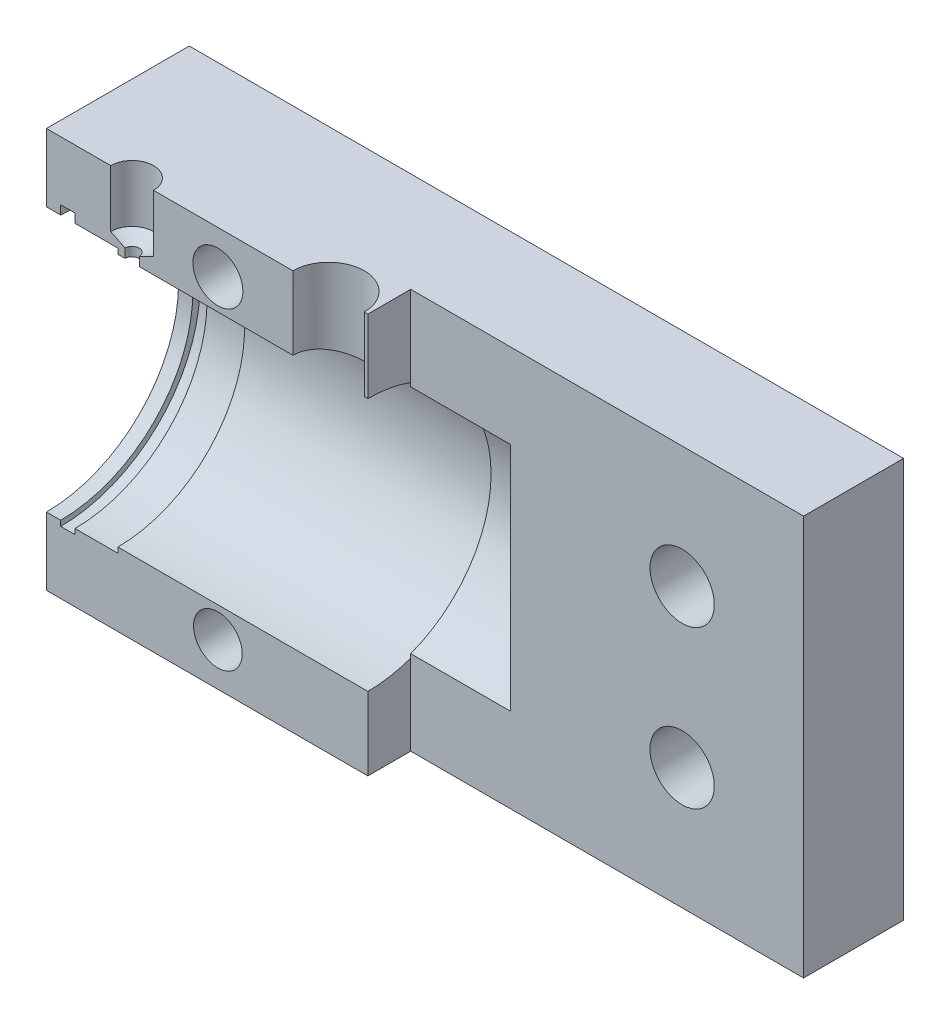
from build123d import *

# Parameters (mm, degrees)
ESQUISSE1_W                              = 100
ESQUISSE1_H                              = 56
BASE_EXTRUSION_DEPTH                     = 40
ESQUISSE3_R                              = 4.5
ENL_V_MAT_EXTRU_2_DEPTH                  = 40
ESQUISSE4_R                              = 17.75
ENL_V_MAT_EXTRU_4_DEPTH                  = 45
ESQUISSE5_R                              = 18.5
ENL_V_MAT_EXTRU_5_DEPTH                  = 10
ESQUISSE6_W                              = 12
ESQUISSE6_H                              = 56
ENL_V_MAT_EXTRU_6_DEPTH                  = 55
ESQUISSE7_W                              = 100
ESQUISSE7_H                              = 56
ENL_V_MAT_EXTRU_7_DEPTH                  = 20
ESQUISSE8_R                              = 3
ENL_V_MAT_EXTRU_8_DEPTH                  = 8
ESQUISSE9_R                              = 1
ENL_V_MAT_EXTRU_9_DEPTH                  = 8
ESQUISSE10_R                             = 5
ENL_V_MAT_EXTRU_10_DEPTH                 = 14
ESQUISSE11_W                             = 2
ESQUISSE11_H                             = 1.75
ENLEVER_DE_LA_MATI_RE_R_VOLUTION11_ANGLE = 180
ESQUISSE12_R                             = 8.5
ENL_V_MAT_EXTRU_11_DEPTH                 = 5
ENLEVER_DE_LA_MATI_RE_R_VOLUTION12_ANGLE = 180
ESQUISSE16_R                             = 3.5
ESQUISSE16_R_2                           = 3.410301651
ENL_V_MAT_EXTRU_12_DEPTH                 = 20
ESQUISSE18_R                             = 2.5
ENL_V_MAT_EXTRU_15_DEPTH                 = 15
ESQUISSE19_R                             = 17.25
ENL_V_MAT_EXTRU_16_DEPTH                 = 14
ESQUISSE20_R                             = 4.5
ENL_V_MAT_EXTRU_17_DEPTH                 = 38


with BuildPart() as part:
    # Esquisse1 → Base-Extrusion (new body)
    with BuildSketch(Plane.XY):
        with Locations((20, 12)):
            Rectangle(ESQUISSE1_W, ESQUISSE1_H)
    extrude(amount=BASE_EXTRUSION_DEPTH)

    # Esquisse3 → Enl_v. mat.-Extru.2 (cut)
    with BuildSketch(Plane.XY.offset(40)):
        with Locations(Location((53, 23, 0), (0, 0, 180))):
            Circle(ESQUISSE3_R)
        with Locations(Location((53, 1, 0), (0, 0, 180))):
            Circle(ESQUISSE3_R)
    extrude(amount=-ENL_V_MAT_EXTRU_2_DEPTH, mode=Mode.SUBTRACT)

    # Esquisse4 → Enl_v. mat.-Extru.4 (cut)
    with BuildSketch(Plane.ZY.offset(30)):
        with Locations((20, 12)):
            Circle(ESQUISSE4_R)
    extrude(amount=-ENL_V_MAT_EXTRU_4_DEPTH, mode=Mode.SUBTRACT)

    # Esquisse5 → Enl_v. mat.-Extru.5 (cut)
    with BuildSketch(Plane.ZY.offset(30)):
        with Locations((20, 12)):
            Circle(ESQUISSE5_R)
    extrude(amount=-ENL_V_MAT_EXTRU_5_DEPTH, mode=Mode.SUBTRACT)

    # Esquisse6 → Enl_v. mat.-Extru.6 (cut)
    with BuildSketch(Plane(origin=(70, 0, 0), x_dir=(0, 0, -1), z_dir=(1, 0, 0))):
        with Locations((-20, 12)):
            Rectangle(ESQUISSE6_W, ESQUISSE6_H)
    extrude(amount=-ENL_V_MAT_EXTRU_6_DEPTH, mode=Mode.SUBTRACT)

    # Esquisse7 → Enl_v. mat.-Extru.7 (cut)
    with BuildSketch(Plane.XY.offset(40)):
        with Locations((20, 12)):
            Rectangle(ESQUISSE7_W, ESQUISSE7_H)
    extrude(amount=-ENL_V_MAT_EXTRU_7_DEPTH, mode=Mode.SUBTRACT)

    # Esquisse8 → Enl_v. mat.-Extru.8 (cut)
    with BuildSketch(Plane(origin=(0, 40, 0), x_dir=(-1, 0, 0), z_dir=(0, 1, 0))):
        with Locations((18, 20)):
            Circle(ESQUISSE8_R)
    extrude(amount=-ENL_V_MAT_EXTRU_8_DEPTH, mode=Mode.SUBTRACT)

    # Esquisse9 → Enl_v. mat.-Extru.9 (cut)
    with BuildSketch(Plane(origin=(0, 32, 0), x_dir=(-1, 0, 0), z_dir=(0, 1, 0))):
        with Locations((18, 20)):
            Circle(ESQUISSE9_R)
    extrude(amount=-ENL_V_MAT_EXTRU_9_DEPTH, mode=Mode.SUBTRACT)

    # Esquisse10 → Enl_v. mat.-Extru.10 (cut)
    with BuildSketch(Plane(origin=(0, 40, 0), x_dir=(-1, 0, 0), z_dir=(0, 1, 0))):
        with Locations((-9.5, 20)):
            Circle(ESQUISSE10_R)
    extrude(amount=-ENL_V_MAT_EXTRU_10_DEPTH, mode=Mode.SUBTRACT)

    # Esquisse11 → Enlever de la mati_re-R_volution11 (revolve, cut)
    with BuildSketch(Plane.XY.offset(20)):
        with Locations((-27, 30.875)):
            Rectangle(ESQUISSE11_W, ESQUISSE11_H)
    revolve(axis=Axis((-30, 12.25, 20), (-1, 0, 0)), revolution_arc=ENLEVER_DE_LA_MATI_RE_R_VOLUTION11_ANGLE, mode=Mode.SUBTRACT)

    # Esquisse12 → Enl_v. mat.-Extru.11 (cut)
    with BuildSketch(Plane(origin=(0, 0, 0), x_dir=(-1, 0, 0), z_dir=(0, 0, -1))):
        with Locations((-53, 23)):
            Circle(ESQUISSE12_R)
        with Locations((-53, 1)):
            Circle(ESQUISSE12_R)
    extrude(amount=-ENL_V_MAT_EXTRU_11_DEPTH, mode=Mode.SUBTRACT)

    # Esquisse15 → Enlever de la mati_re-R_volution12 (revolve, cut)
    with BuildSketch(Plane.XY.offset(20)):
        Polygon((-21, 32), (-19, 31), (-19, 32), align=None)
    revolve(axis=Axis((-18, 31, 20), (0, -1, 0)), revolution_arc=ENLEVER_DE_LA_MATI_RE_R_VOLUTION12_ANGLE, mode=Mode.SUBTRACT)

    # Esquisse16 → Enl_v. mat.-Extru.12 (cut)
    with BuildSketch(Plane.XY.offset(20)):
        with Locations((-6, 34)):
            Circle(ESQUISSE16_R)
        with Locations((-6, -10)):
            Circle(ESQUISSE16_R_2)
    extrude(amount=-ENL_V_MAT_EXTRU_12_DEPTH, mode=Mode.SUBTRACT)

    # Esquisse18 → Enl_v. mat.-Extru.15 (cut)
    with BuildSketch(Plane.ZY.offset(30)):
        with Locations((6, 34)):
            Circle(ESQUISSE18_R)
        with Locations(Location((6, -10, 0), (0, 0, 180))):
            Circle(ESQUISSE18_R)
    extrude(amount=-ENL_V_MAT_EXTRU_15_DEPTH, mode=Mode.SUBTRACT)

    # Esquisse19 → Enl_v. mat.-Extru.16 (cut)
    with BuildSketch(Plane.ZY.offset(-15)):
        with Locations((20, 12)):
            Circle(ESQUISSE19_R)
    extrude(amount=-ENL_V_MAT_EXTRU_16_DEPTH, mode=Mode.SUBTRACT)

    # Esquisse20 → Enl_v. mat.-Extru.17 (cut)
    with BuildSketch(Plane.ZY.offset(-29)):
        with Locations((9.002133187, 12.216623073)):
            Circle(ESQUISSE20_R)
    extrude(amount=-ENL_V_MAT_EXTRU_17_DEPTH, mode=Mode.SUBTRACT)


solid = part.part
